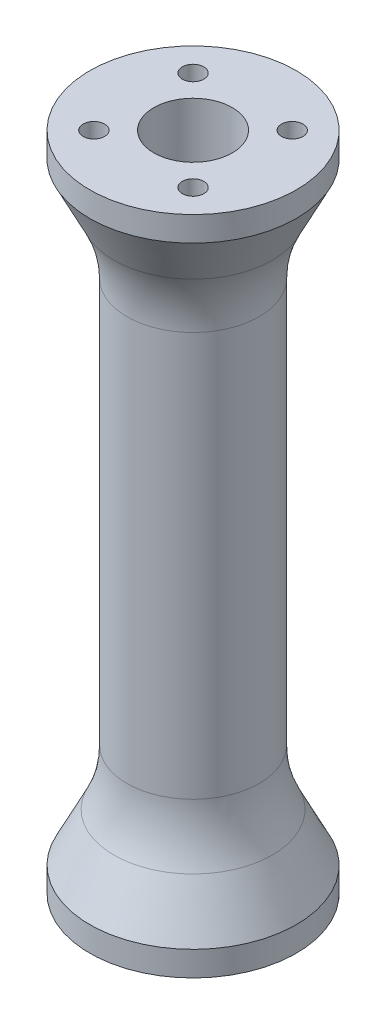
from build123d import *

# Parameters (mm, degrees)
SKETCH2_R          = 1.3
CUT_EXTRUDE1_DEPTH = 7
SKETCH4_R          = 4.75
CUT_EXTRUDE2_DEPTH = 82.929848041
FILLET1_R          = 15
FILLET2_R          = 4


with BuildPart() as part:
    # Sketch1 → Revolve1 (revolve)
    with BuildSketch(Plane.XY, mode=Mode.PRIVATE) as revolve1_sk:
        Polygon((0, -40), (0, 40), (-12.5, 40), (-12.5, 37), (-8, 28), (-8, -28), (-12.5, -37), (-12.5, -40), align=None)
    revolve(revolve1_sk.sketch.rotate(Axis((0, -40, 0), (0, 1, 0)), 270), axis=Axis((0, -40, 0), (0, 1, 0)))

    # Sketch2 → Cut-Extrude1 (cut)
    with BuildSketch(Plane(origin=(0, 40, 0), x_dir=(1, 0, 0), z_dir=(0, 1, 0))):
        with Locations(Location((-6, 6, 0), (0, 0, 270))):
            Circle(SKETCH2_R)
        with Locations(Location((6, 6, 0), (0, 0, 270))):
            Circle(SKETCH2_R)
        with Locations(Location((-6, -6, 0), (0, 0, 270))):
            Circle(SKETCH2_R)
        with Locations(Location((6, -6, 0), (0, 0, 270))):
            Circle(SKETCH2_R)
    cut_extrude1 = extrude(amount=-CUT_EXTRUDE1_DEPTH, mode=Mode.SUBTRACT)

    # Mirror1: Cut-Extrude1 across plane
    add(cut_extrude1.mirror(Plane.ZX), mode=Mode.SUBTRACT)

    # Sketch3 → Cut-Revolve1 (revolve, cut)
    with BuildSketch(Plane(origin=(0, 0, 0), x_dir=(0, 0, -1), z_dir=(1, 0, 0))):
        Polygon((-7, 29.7), (0, 36.7), (0, -36.7), (-7, -29.7), align=None)
    revolve(axis=Axis((0, 36.7, 0), (0, -1, 0)), mode=Mode.SUBTRACT)

    # Sketch4 → Cut-Extrude2 (cut, through all)
    with BuildSketch(Plane(origin=(0, 40, 0), x_dir=(1, 0, 0), z_dir=(0, 1, 0))):
        with Locations(Location((0, 0, 0), (0, 0, 270))):
            Circle(SKETCH4_R)
    extrude(amount=-CUT_EXTRUDE2_DEPTH, mode=Mode.SUBTRACT)

    # Fillet1
    fillet1_edges = [part.edges().sort_by_distance(p)[0] for p in [
        (0, -28, 8),
        (0, 28, 8),
    ]]
    fillet(fillet1_edges, radius=FILLET1_R)

    # Fillet2
    fillet2_edges = [part.edges().sort_by_distance(p)[0] for p in [
        (0, 29.7, -7),
        (0, -29.7, -7),
    ]]
    fillet(fillet2_edges, radius=FILLET2_R)


solid = part.part
